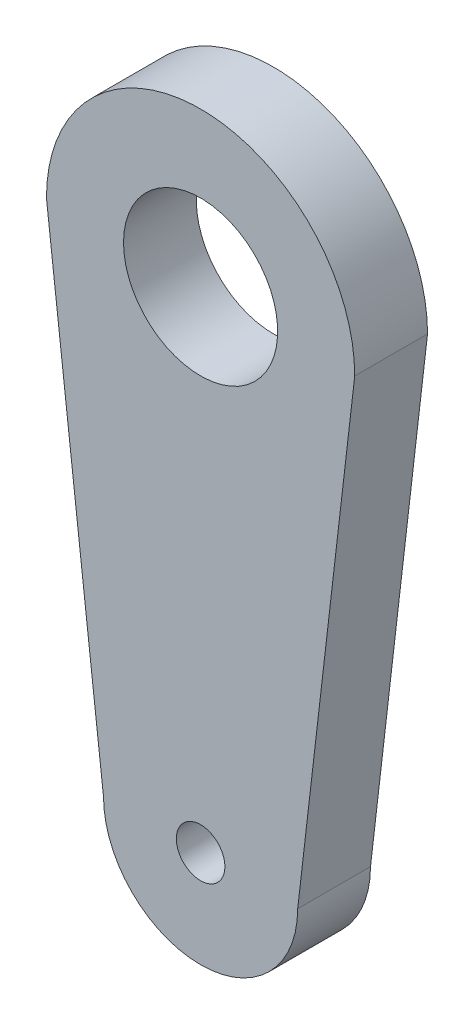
ISO-10303-21;
HEADER;
FILE_DESCRIPTION(('STEP AP214'),'2;1');
FILE_NAME('part.step','',(''),(''),'','','');
FILE_SCHEMA(('AUTOMOTIVE_DESIGN { 1 0 10303 214 1 1 1 1 }'));
ENDSEC;
DATA;
#1=APPLICATION_CONTEXT('core data for automotive mechanical design processes');
#2=APPLICATION_PROTOCOL_DEFINITION('international standard','automotive_design',2000,#1);
#3=PRODUCT_CONTEXT('',#1,'mechanical');
#4=PRODUCT('Part','Part','',(#3));
#5=PRODUCT_RELATED_PRODUCT_CATEGORY('part','',(#4));
#6=PRODUCT_DEFINITION_FORMATION('','',#4);
#7=PRODUCT_DEFINITION_CONTEXT('part definition',#1,'design');
#8=PRODUCT_DEFINITION('design','',#6,#7);
#9=PRODUCT_DEFINITION_SHAPE('','',#8);
#10=(LENGTH_UNIT() NAMED_UNIT(*) SI_UNIT(.MILLI.,.METRE.));
#11=(NAMED_UNIT(*) PLANE_ANGLE_UNIT() SI_UNIT($,.RADIAN.));
#12=(NAMED_UNIT(*) SI_UNIT($,.STERADIAN.) SOLID_ANGLE_UNIT());
#13=UNCERTAINTY_MEASURE_WITH_UNIT(LENGTH_MEASURE(1.E-05),#10,'distance_accuracy_value','');
#14=(GEOMETRIC_REPRESENTATION_CONTEXT(3) GLOBAL_UNCERTAINTY_ASSIGNED_CONTEXT((#13)) GLOBAL_UNIT_ASSIGNED_CONTEXT((#10,
#11,#12)) REPRESENTATION_CONTEXT('',''));
#15=CARTESIAN_POINT('',(0.,0.,0.));
#16=DIRECTION('',(0.,0.,1.));
#17=DIRECTION('',(1.,0.,0.));
#18=AXIS2_PLACEMENT_3D('',#15,#16,#17);
#19=CARTESIAN_POINT('',(0.,-20.1836542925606,1.49987));
#20=DIRECTION('',(0.,0.,-1.));
#21=DIRECTION('',(-1.,0.,0.));
#22=AXIS2_PLACEMENT_3D('',#19,#20,#21);
#23=CYLINDRICAL_SURFACE('',#22,4.000000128);
#24=CARTESIAN_POINT('',(0.,-20.1836542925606,-1.49987));
#25=DIRECTION('',(0.,0.,1.));
#26=DIRECTION('',(1.,0.,0.));
#27=AXIS2_PLACEMENT_3D('',#24,#25,#26);
#28=CIRCLE('',#27,4.000000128);
#29=CARTESIAN_POINT('',(-4.000000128,-20.1836542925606,-1.49987));
#30=VERTEX_POINT('',#29);
#31=CARTESIAN_POINT('',(4.000000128,-20.1836542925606,-1.49987));
#32=VERTEX_POINT('',#31);
#33=EDGE_CURVE('E114',#30,#32,#28,.T.);
#34=ORIENTED_EDGE('',*,*,#33,.T.);
#35=DIRECTION('',(0.,0.,-1.));
#36=VECTOR('',#35,1.);
#37=CARTESIAN_POINT('',(4.000000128,-20.1836542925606,1.49987));
#38=LINE('',#37,#36);
#39=CARTESIAN_POINT('',(4.000000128,-20.1836542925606,1.49987));
#40=VERTEX_POINT('',#39);
#41=EDGE_CURVE('E11',#40,#32,#38,.T.);
#42=ORIENTED_EDGE('',*,*,#41,.F.);
#43=CARTESIAN_POINT('',(0.,-20.1836542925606,1.49987));
#44=DIRECTION('',(0.,0.,1.));
#45=DIRECTION('',(1.,0.,0.));
#46=AXIS2_PLACEMENT_3D('',#43,#44,#45);
#47=CIRCLE('',#46,4.000000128);
#48=CARTESIAN_POINT('',(-4.000000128,-20.1836542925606,1.49987));
#49=VERTEX_POINT('',#48);
#50=EDGE_CURVE('E85',#49,#40,#47,.T.);
#51=ORIENTED_EDGE('',*,*,#50,.F.);
#52=DIRECTION('',(0.,0.,-1.));
#53=VECTOR('',#52,1.);
#54=CARTESIAN_POINT('',(-4.000000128,-20.1836542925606,1.49987));
#55=LINE('',#54,#53);
#56=EDGE_CURVE('E113',#49,#30,#55,.T.);
#57=ORIENTED_EDGE('',*,*,#56,.T.);
#58=EDGE_LOOP('',(#34,#42,#51,#57));
#59=FACE_BOUND('',#58,.T.);
#60=ADVANCED_FACE('F43',(#59),#23,.T.);
#61=CARTESIAN_POINT('',(6.26506982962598,-0.729447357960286,1.49987));
#62=DIRECTION('',(0.993290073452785,-0.1156496,0.));
#63=DIRECTION('',(0.1156496,0.993290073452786,0.));
#64=AXIS2_PLACEMENT_3D('',#61,#62,#63);
#65=PLANE('',#64);
#66=DIRECTION('',(-0.1156496,-0.993290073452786,0.));
#67=VECTOR('',#66,1.);
#68=CARTESIAN_POINT('',(6.26506982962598,-0.729447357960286,-1.49987));
#69=LINE('',#68,#67);
#70=CARTESIAN_POINT('',(6.35,0.,-1.49987));
#71=VERTEX_POINT('',#70);
#72=EDGE_CURVE('E95',#71,#32,#69,.T.);
#73=ORIENTED_EDGE('',*,*,#72,.F.);
#74=DIRECTION('',(0.,0.,-1.));
#75=VECTOR('',#74,1.);
#76=CARTESIAN_POINT('',(6.35,0.,1.49987));
#77=LINE('',#76,#75);
#78=CARTESIAN_POINT('',(6.35,0.,1.49987));
#79=VERTEX_POINT('',#78);
#80=EDGE_CURVE('E51',#79,#71,#77,.T.);
#81=ORIENTED_EDGE('',*,*,#80,.F.);
#82=DIRECTION('',(-0.1156496,-0.993290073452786,0.));
#83=VECTOR('',#82,1.);
#84=CARTESIAN_POINT('',(6.26506982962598,-0.729447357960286,1.49987));
#85=LINE('',#84,#83);
#86=EDGE_CURVE('E93',#79,#40,#85,.T.);
#87=ORIENTED_EDGE('',*,*,#86,.T.);
#88=ORIENTED_EDGE('',*,*,#41,.T.);
#89=EDGE_LOOP('',(#73,#81,#87,#88));
#90=FACE_BOUND('',#89,.T.);
#91=ADVANCED_FACE('F92',(#90),#65,.T.);
#92=CARTESIAN_POINT('',(0.,0.,1.49987));
#93=DIRECTION('',(0.,0.,-1.));
#94=DIRECTION('',(-1.,0.,0.));
#95=AXIS2_PLACEMENT_3D('',#92,#93,#94);
#96=CYLINDRICAL_SURFACE('',#95,6.35);
#97=CARTESIAN_POINT('',(0.,0.,-1.49987));
#98=DIRECTION('',(0.,0.,1.));
#99=DIRECTION('',(1.,0.,0.));
#100=AXIS2_PLACEMENT_3D('',#97,#98,#99);
#101=CIRCLE('',#100,6.35);
#102=CARTESIAN_POINT('',(-6.35,0.,-1.49987));
#103=VERTEX_POINT('',#102);
#104=EDGE_CURVE('E74',#71,#103,#101,.T.);
#105=ORIENTED_EDGE('',*,*,#104,.T.);
#106=DIRECTION('',(0.,0.,-1.));
#107=VECTOR('',#106,1.);
#108=CARTESIAN_POINT('',(-6.35,0.,1.49987));
#109=LINE('',#108,#107);
#110=CARTESIAN_POINT('',(-6.35,0.,1.49987));
#111=VERTEX_POINT('',#110);
#112=EDGE_CURVE('E96',#111,#103,#109,.T.);
#113=ORIENTED_EDGE('',*,*,#112,.F.);
#114=CARTESIAN_POINT('',(0.,0.,1.49987));
#115=DIRECTION('',(0.,0.,1.));
#116=DIRECTION('',(1.,0.,0.));
#117=AXIS2_PLACEMENT_3D('',#114,#115,#116);
#118=CIRCLE('',#117,6.35);
#119=EDGE_CURVE('E97',#79,#111,#118,.T.);
#120=ORIENTED_EDGE('',*,*,#119,.F.);
#121=ORIENTED_EDGE('',*,*,#80,.T.);
#122=EDGE_LOOP('',(#105,#113,#120,#121));
#123=FACE_BOUND('',#122,.T.);
#124=ADVANCED_FACE('F98',(#123),#96,.T.);
#125=CARTESIAN_POINT('',(0.,-20.1836542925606,1.49987));
#126=DIRECTION('',(0.,0.,-1.));
#127=DIRECTION('',(-1.,0.,0.));
#128=AXIS2_PLACEMENT_3D('',#125,#126,#127);
#129=CYLINDRICAL_SURFACE('',#128,1.00000003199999);
#130=CARTESIAN_POINT('',(0.,-20.1836542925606,1.49987));
#131=DIRECTION('',(0.,0.,1.));
#132=DIRECTION('',(1.,0.,0.));
#133=AXIS2_PLACEMENT_3D('',#130,#131,#132);
#134=CIRCLE('',#133,1.00000003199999);
#135=CARTESIAN_POINT('',(-1.00000003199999,-20.1836542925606,1.49987));
#136=VERTEX_POINT('',#135);
#137=EDGE_CURVE('E107',#136,#136,#134,.T.);
#138=CARTESIAN_POINT('',(0.,-20.1836542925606,-1.49987));
#139=DIRECTION('',(0.,0.,1.));
#140=DIRECTION('',(1.,0.,0.));
#141=AXIS2_PLACEMENT_3D('',#138,#139,#140);
#142=CIRCLE('',#141,1.00000003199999);
#143=CARTESIAN_POINT('',(-1.00000003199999,-20.1836542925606,-1.49987));
#144=VERTEX_POINT('',#143);
#145=EDGE_CURVE('E120',#144,#144,#142,.T.);
#146=CARTESIAN_POINT('',(-1.00000003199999,-20.1836542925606,1.49987));
#147=CARTESIAN_POINT('',(-1.00000003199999,-20.1836542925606,1.46862270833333));
#148=CARTESIAN_POINT('',(-1.00000003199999,-20.1836542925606,1.43737541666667));
#149=CARTESIAN_POINT('',(-1.00000003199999,-20.1836542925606,1.37488083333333));
#150=CARTESIAN_POINT('',(-1.00000003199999,-20.1836542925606,1.34363354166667));
#151=CARTESIAN_POINT('',(-1.00000003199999,-20.1836542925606,1.28113895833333));
#152=CARTESIAN_POINT('',(-1.00000003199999,-20.1836542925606,1.24989166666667));
#153=CARTESIAN_POINT('',(-1.00000003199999,-20.1836542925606,1.18739708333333));
#154=CARTESIAN_POINT('',(-1.00000003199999,-20.1836542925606,1.15614979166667));
#155=CARTESIAN_POINT('',(-1.00000003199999,-20.1836542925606,1.09365520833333));
#156=CARTESIAN_POINT('',(-1.00000003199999,-20.1836542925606,1.06240791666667));
#157=CARTESIAN_POINT('',(-1.00000003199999,-20.1836542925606,0.999913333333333));
#158=CARTESIAN_POINT('',(-1.00000003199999,-20.1836542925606,0.968666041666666));
#159=CARTESIAN_POINT('',(-1.00000003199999,-20.1836542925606,0.906171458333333));
#160=CARTESIAN_POINT('',(-1.00000003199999,-20.1836542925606,0.874924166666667));
#161=CARTESIAN_POINT('',(-1.00000003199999,-20.1836542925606,0.812429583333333));
#162=CARTESIAN_POINT('',(-1.00000003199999,-20.1836542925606,0.781182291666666));
#163=CARTESIAN_POINT('',(-1.00000003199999,-20.1836542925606,0.718687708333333));
#164=CARTESIAN_POINT('',(-1.00000003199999,-20.1836542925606,0.687440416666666));
#165=CARTESIAN_POINT('',(-1.00000003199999,-20.1836542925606,0.624945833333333));
#166=CARTESIAN_POINT('',(-1.00000003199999,-20.1836542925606,0.593698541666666));
#167=CARTESIAN_POINT('',(-1.00000003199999,-20.1836542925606,0.531203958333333));
#168=CARTESIAN_POINT('',(-1.00000003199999,-20.1836542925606,0.499956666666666));
#169=CARTESIAN_POINT('',(-1.00000003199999,-20.1836542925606,0.437462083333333));
#170=CARTESIAN_POINT('',(-1.00000003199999,-20.1836542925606,0.406214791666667));
#171=CARTESIAN_POINT('',(-1.00000003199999,-20.1836542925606,0.343720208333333));
#172=CARTESIAN_POINT('',(-1.00000003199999,-20.1836542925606,0.312472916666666));
#173=CARTESIAN_POINT('',(-1.00000003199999,-20.1836542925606,0.249978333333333));
#174=CARTESIAN_POINT('',(-1.00000003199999,-20.1836542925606,0.218731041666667));
#175=CARTESIAN_POINT('',(-1.00000003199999,-20.1836542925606,0.156236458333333));
#176=CARTESIAN_POINT('',(-1.00000003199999,-20.1836542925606,0.124989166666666));
#177=CARTESIAN_POINT('',(-1.00000003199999,-20.1836542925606,0.0624945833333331));
#178=CARTESIAN_POINT('',(-1.00000003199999,-20.1836542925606,0.0312472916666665));
#179=CARTESIAN_POINT('',(-1.00000003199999,-20.1836542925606,-0.0312472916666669));
#180=CARTESIAN_POINT('',(-1.00000003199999,-20.1836542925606,-0.0624945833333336));
#181=CARTESIAN_POINT('',(-1.00000003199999,-20.1836542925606,-0.124989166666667));
#182=CARTESIAN_POINT('',(-1.00000003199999,-20.1836542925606,-0.156236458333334));
#183=CARTESIAN_POINT('',(-1.00000003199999,-20.1836542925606,-0.218731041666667));
#184=CARTESIAN_POINT('',(-1.00000003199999,-20.1836542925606,-0.249978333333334));
#185=CARTESIAN_POINT('',(-1.00000003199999,-20.1836542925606,-0.312472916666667));
#186=CARTESIAN_POINT('',(-1.00000003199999,-20.1836542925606,-0.343720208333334));
#187=CARTESIAN_POINT('',(-1.00000003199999,-20.1836542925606,-0.406214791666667));
#188=CARTESIAN_POINT('',(-1.00000003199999,-20.1836542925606,-0.437462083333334));
#189=CARTESIAN_POINT('',(-1.00000003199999,-20.1836542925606,-0.499956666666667));
#190=CARTESIAN_POINT('',(-1.00000003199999,-20.1836542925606,-0.531203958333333));
#191=CARTESIAN_POINT('',(-1.00000003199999,-20.1836542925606,-0.593698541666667));
#192=CARTESIAN_POINT('',(-1.00000003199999,-20.1836542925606,-0.624945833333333));
#193=CARTESIAN_POINT('',(-1.00000003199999,-20.1836542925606,-0.687440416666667));
#194=CARTESIAN_POINT('',(-1.00000003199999,-20.1836542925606,-0.718687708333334));
#195=CARTESIAN_POINT('',(-1.00000003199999,-20.1836542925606,-0.781182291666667));
#196=CARTESIAN_POINT('',(-1.00000003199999,-20.1836542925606,-0.812429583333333));
#197=CARTESIAN_POINT('',(-1.00000003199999,-20.1836542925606,-0.874924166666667));
#198=CARTESIAN_POINT('',(-1.00000003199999,-20.1836542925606,-0.906171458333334));
#199=CARTESIAN_POINT('',(-1.00000003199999,-20.1836542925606,-0.968666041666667));
#200=CARTESIAN_POINT('',(-1.00000003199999,-20.1836542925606,-0.999913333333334));
#201=CARTESIAN_POINT('',(-1.00000003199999,-20.1836542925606,-1.06240791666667));
#202=CARTESIAN_POINT('',(-1.00000003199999,-20.1836542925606,-1.09365520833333));
#203=CARTESIAN_POINT('',(-1.00000003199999,-20.1836542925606,-1.15614979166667));
#204=CARTESIAN_POINT('',(-1.00000003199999,-20.1836542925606,-1.18739708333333));
#205=CARTESIAN_POINT('',(-1.00000003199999,-20.1836542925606,-1.24989166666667));
#206=CARTESIAN_POINT('',(-1.00000003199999,-20.1836542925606,-1.28113895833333));
#207=CARTESIAN_POINT('',(-1.00000003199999,-20.1836542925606,-1.34363354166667));
#208=CARTESIAN_POINT('',(-1.00000003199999,-20.1836542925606,-1.37488083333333));
#209=CARTESIAN_POINT('',(-1.00000003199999,-20.1836542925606,-1.43737541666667));
#210=CARTESIAN_POINT('',(-1.00000003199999,-20.1836542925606,-1.46862270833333));
#211=CARTESIAN_POINT('',(-1.00000003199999,-20.1836542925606,-1.49987));
#212=B_SPLINE_CURVE_WITH_KNOTS('',3,(#146,#147,#148,#149,#150,#151,#152,#153,#154,#155,#156,
#157,#158,#159,#160,#161,#162,#163,#164,#165,#166,#167,#168,#169,#170,#171,#172,#173,#174,#175,
#176,#177,#178,#179,#180,#181,#182,#183,#184,#185,#186,#187,#188,#189,#190,#191,#192,#193,#194,
#195,#196,#197,#198,#199,#200,#201,#202,#203,#204,#205,#206,#207,#208,#209,#210,#211),
.UNSPECIFIED.,.F.,.F.,(4,2,2,2,2,2,2,2,2,2,2,2,2,2,2,2,2,2,2,2,2,2,2,2,2,2,2,2,2,2,2,2,4),(0.,
0.093741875,0.18748375,0.281225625,0.3749675,0.468709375,0.56245125,0.656193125,0.749935,
0.843676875,0.93741875,1.031160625,1.1249025,1.218644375,1.31238625,1.406128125,1.49987,
1.593611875,1.68735375,1.781095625,1.8748375,1.968579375,2.06232125,2.156063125,2.249805,
2.343546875,2.43728875,2.531030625,2.6247725,2.718514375,2.81225625,2.905998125,2.99974),.UNSPECIFIED.);
#213=EDGE_CURVE('BSEAM139',#136,#144,#212,.T.);
#214=ORIENTED_EDGE('',*,*,#137,.T.);
#215=ORIENTED_EDGE('',*,*,#145,.F.);
#216=ORIENTED_EDGE('',*,*,#213,.T.);
#217=ORIENTED_EDGE('',*,*,#213,.F.);
#218=EDGE_LOOP('',(#214,#216,#215,#217));
#219=FACE_BOUND('',#218,.T.);
#220=ADVANCED_FACE('F139',(#219),#129,.F.);
#221=CARTESIAN_POINT('',(-6.26506982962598,-0.729447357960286,1.49987));
#222=DIRECTION('',(0.993290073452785,0.1156496,0.));
#223=DIRECTION('',(-0.1156496,0.993290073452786,0.));
#224=AXIS2_PLACEMENT_3D('',#221,#222,#223);
#225=PLANE('',#224);
#226=DIRECTION('',(0.1156496,-0.993290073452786,0.));
#227=VECTOR('',#226,1.);
#228=CARTESIAN_POINT('',(-6.26506982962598,-0.729447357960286,-1.49987));
#229=LINE('',#228,#227);
#230=EDGE_CURVE('E80',#103,#30,#229,.T.);
#231=ORIENTED_EDGE('',*,*,#230,.T.);
#232=ORIENTED_EDGE('',*,*,#56,.F.);
#233=DIRECTION('',(0.1156496,-0.993290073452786,0.));
#234=VECTOR('',#233,1.);
#235=CARTESIAN_POINT('',(-6.26506982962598,-0.729447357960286,1.49987));
#236=LINE('',#235,#234);
#237=EDGE_CURVE('E59',#111,#49,#236,.T.);
#238=ORIENTED_EDGE('',*,*,#237,.F.);
#239=ORIENTED_EDGE('',*,*,#112,.T.);
#240=EDGE_LOOP('',(#231,#232,#238,#239));
#241=FACE_BOUND('',#240,.T.);
#242=ADVANCED_FACE('F126',(#241),#225,.F.);
#243=CARTESIAN_POINT('',(0.,0.,1.49987));
#244=DIRECTION('',(0.,0.,-1.));
#245=DIRECTION('',(-1.,0.,0.));
#246=AXIS2_PLACEMENT_3D('',#243,#244,#245);
#247=CYLINDRICAL_SURFACE('',#246,3.175);
#248=CARTESIAN_POINT('',(0.,0.,1.49987));
#249=DIRECTION('',(0.,0.,1.));
#250=DIRECTION('',(1.,0.,0.));
#251=AXIS2_PLACEMENT_3D('',#248,#249,#250);
#252=CIRCLE('',#251,3.175);
#253=CARTESIAN_POINT('',(-3.175,0.,1.49987));
#254=VERTEX_POINT('',#253);
#255=EDGE_CURVE('E110',#254,#254,#252,.T.);
#256=CARTESIAN_POINT('',(0.,0.,-1.49987));
#257=DIRECTION('',(0.,0.,1.));
#258=DIRECTION('',(1.,0.,0.));
#259=AXIS2_PLACEMENT_3D('',#256,#257,#258);
#260=CIRCLE('',#259,3.175);
#261=CARTESIAN_POINT('',(-3.175,0.,-1.49987));
#262=VERTEX_POINT('',#261);
#263=EDGE_CURVE('E103',#262,#262,#260,.T.);
#264=CARTESIAN_POINT('',(-3.175,0.,1.49987));
#265=CARTESIAN_POINT('',(-3.175,0.,1.46862270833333));
#266=CARTESIAN_POINT('',(-3.175,0.,1.43737541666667));
#267=CARTESIAN_POINT('',(-3.175,0.,1.37488083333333));
#268=CARTESIAN_POINT('',(-3.175,0.,1.34363354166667));
#269=CARTESIAN_POINT('',(-3.175,0.,1.28113895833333));
#270=CARTESIAN_POINT('',(-3.175,0.,1.24989166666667));
#271=CARTESIAN_POINT('',(-3.175,0.,1.18739708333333));
#272=CARTESIAN_POINT('',(-3.175,0.,1.15614979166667));
#273=CARTESIAN_POINT('',(-3.175,0.,1.09365520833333));
#274=CARTESIAN_POINT('',(-3.175,0.,1.06240791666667));
#275=CARTESIAN_POINT('',(-3.175,0.,0.999913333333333));
#276=CARTESIAN_POINT('',(-3.175,0.,0.968666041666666));
#277=CARTESIAN_POINT('',(-3.175,0.,0.906171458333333));
#278=CARTESIAN_POINT('',(-3.175,0.,0.874924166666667));
#279=CARTESIAN_POINT('',(-3.175,0.,0.812429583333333));
#280=CARTESIAN_POINT('',(-3.175,0.,0.781182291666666));
#281=CARTESIAN_POINT('',(-3.175,0.,0.718687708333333));
#282=CARTESIAN_POINT('',(-3.175,0.,0.687440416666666));
#283=CARTESIAN_POINT('',(-3.175,0.,0.624945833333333));
#284=CARTESIAN_POINT('',(-3.175,0.,0.593698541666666));
#285=CARTESIAN_POINT('',(-3.175,0.,0.531203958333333));
#286=CARTESIAN_POINT('',(-3.175,0.,0.499956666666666));
#287=CARTESIAN_POINT('',(-3.175,0.,0.437462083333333));
#288=CARTESIAN_POINT('',(-3.175,0.,0.406214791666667));
#289=CARTESIAN_POINT('',(-3.175,0.,0.343720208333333));
#290=CARTESIAN_POINT('',(-3.175,0.,0.312472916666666));
#291=CARTESIAN_POINT('',(-3.175,0.,0.249978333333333));
#292=CARTESIAN_POINT('',(-3.175,0.,0.218731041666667));
#293=CARTESIAN_POINT('',(-3.175,0.,0.156236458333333));
#294=CARTESIAN_POINT('',(-3.175,0.,0.124989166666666));
#295=CARTESIAN_POINT('',(-3.175,0.,0.0624945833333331));
#296=CARTESIAN_POINT('',(-3.175,0.,0.0312472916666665));
#297=CARTESIAN_POINT('',(-3.175,0.,-0.0312472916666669));
#298=CARTESIAN_POINT('',(-3.175,0.,-0.0624945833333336));
#299=CARTESIAN_POINT('',(-3.175,0.,-0.124989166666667));
#300=CARTESIAN_POINT('',(-3.175,0.,-0.156236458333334));
#301=CARTESIAN_POINT('',(-3.175,0.,-0.218731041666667));
#302=CARTESIAN_POINT('',(-3.175,0.,-0.249978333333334));
#303=CARTESIAN_POINT('',(-3.175,0.,-0.312472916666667));
#304=CARTESIAN_POINT('',(-3.175,0.,-0.343720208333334));
#305=CARTESIAN_POINT('',(-3.175,0.,-0.406214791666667));
#306=CARTESIAN_POINT('',(-3.175,0.,-0.437462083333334));
#307=CARTESIAN_POINT('',(-3.175,0.,-0.499956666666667));
#308=CARTESIAN_POINT('',(-3.175,0.,-0.531203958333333));
#309=CARTESIAN_POINT('',(-3.175,0.,-0.593698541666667));
#310=CARTESIAN_POINT('',(-3.175,0.,-0.624945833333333));
#311=CARTESIAN_POINT('',(-3.175,0.,-0.687440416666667));
#312=CARTESIAN_POINT('',(-3.175,0.,-0.718687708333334));
#313=CARTESIAN_POINT('',(-3.175,0.,-0.781182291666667));
#314=CARTESIAN_POINT('',(-3.175,0.,-0.812429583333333));
#315=CARTESIAN_POINT('',(-3.175,0.,-0.874924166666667));
#316=CARTESIAN_POINT('',(-3.175,0.,-0.906171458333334));
#317=CARTESIAN_POINT('',(-3.175,0.,-0.968666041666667));
#318=CARTESIAN_POINT('',(-3.175,0.,-0.999913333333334));
#319=CARTESIAN_POINT('',(-3.175,0.,-1.06240791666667));
#320=CARTESIAN_POINT('',(-3.175,0.,-1.09365520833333));
#321=CARTESIAN_POINT('',(-3.175,0.,-1.15614979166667));
#322=CARTESIAN_POINT('',(-3.175,0.,-1.18739708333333));
#323=CARTESIAN_POINT('',(-3.175,0.,-1.24989166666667));
#324=CARTESIAN_POINT('',(-3.175,0.,-1.28113895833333));
#325=CARTESIAN_POINT('',(-3.175,0.,-1.34363354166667));
#326=CARTESIAN_POINT('',(-3.175,0.,-1.37488083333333));
#327=CARTESIAN_POINT('',(-3.175,0.,-1.43737541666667));
#328=CARTESIAN_POINT('',(-3.175,0.,-1.46862270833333));
#329=CARTESIAN_POINT('',(-3.175,0.,-1.49987));
#330=B_SPLINE_CURVE_WITH_KNOTS('',3,(#264,#265,#266,#267,#268,#269,#270,#271,#272,#273,#274,
#275,#276,#277,#278,#279,#280,#281,#282,#283,#284,#285,#286,#287,#288,#289,#290,#291,#292,#293,
#294,#295,#296,#297,#298,#299,#300,#301,#302,#303,#304,#305,#306,#307,#308,#309,#310,#311,#312,
#313,#314,#315,#316,#317,#318,#319,#320,#321,#322,#323,#324,#325,#326,#327,#328,#329),
.UNSPECIFIED.,.F.,.F.,(4,2,2,2,2,2,2,2,2,2,2,2,2,2,2,2,2,2,2,2,2,2,2,2,2,2,2,2,2,2,2,2,4),(0.,
0.093741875,0.18748375,0.281225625,0.3749675,0.468709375,0.56245125,0.656193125,0.749935,
0.843676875,0.93741875,1.031160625,1.1249025,1.218644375,1.31238625,1.406128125,1.49987,
1.593611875,1.68735375,1.781095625,1.8748375,1.968579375,2.06232125,2.156063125,2.249805,
2.343546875,2.43728875,2.531030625,2.6247725,2.718514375,2.81225625,2.905998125,2.99974),.UNSPECIFIED.);
#331=EDGE_CURVE('BSEAM144',#254,#262,#330,.T.);
#332=ORIENTED_EDGE('',*,*,#255,.T.);
#333=ORIENTED_EDGE('',*,*,#263,.F.);
#334=ORIENTED_EDGE('',*,*,#331,.T.);
#335=ORIENTED_EDGE('',*,*,#331,.F.);
#336=EDGE_LOOP('',(#332,#334,#333,#335));
#337=FACE_BOUND('',#336,.T.);
#338=ADVANCED_FACE('F144',(#337),#247,.F.);
#339=CARTESIAN_POINT('',(0.,0.,1.49987));
#340=DIRECTION('',(0.,0.,1.));
#341=DIRECTION('',(1.,0.,0.));
#342=AXIS2_PLACEMENT_3D('',#339,#340,#341);
#343=PLANE('',#342);
#344=ORIENTED_EDGE('',*,*,#50,.T.);
#345=ORIENTED_EDGE('',*,*,#86,.F.);
#346=ORIENTED_EDGE('',*,*,#119,.T.);
#347=ORIENTED_EDGE('',*,*,#237,.T.);
#348=EDGE_LOOP('',(#344,#345,#346,#347));
#349=FACE_BOUND('',#348,.T.);
#350=ORIENTED_EDGE('',*,*,#137,.F.);
#351=EDGE_LOOP('',(#350));
#352=FACE_BOUND('',#351,.T.);
#353=ORIENTED_EDGE('',*,*,#255,.F.);
#354=EDGE_LOOP('',(#353));
#355=FACE_BOUND('',#354,.T.);
#356=ADVANCED_FACE('F100',(#349,#352,#355),#343,.T.);
#357=CARTESIAN_POINT('',(0.,0.,-1.49987));
#358=DIRECTION('',(0.,0.,1.));
#359=DIRECTION('',(1.,0.,0.));
#360=AXIS2_PLACEMENT_3D('',#357,#358,#359);
#361=PLANE('',#360);
#362=ORIENTED_EDGE('',*,*,#33,.F.);
#363=ORIENTED_EDGE('',*,*,#230,.F.);
#364=ORIENTED_EDGE('',*,*,#104,.F.);
#365=ORIENTED_EDGE('',*,*,#72,.T.);
#366=EDGE_LOOP('',(#362,#363,#364,#365));
#367=FACE_BOUND('',#366,.T.);
#368=ORIENTED_EDGE('',*,*,#145,.T.);
#369=EDGE_LOOP('',(#368));
#370=FACE_BOUND('',#369,.T.);
#371=ORIENTED_EDGE('',*,*,#263,.T.);
#372=EDGE_LOOP('',(#371));
#373=FACE_BOUND('',#372,.T.);
#374=ADVANCED_FACE('F129',(#367,#370,#373),#361,.F.);
#375=CLOSED_SHELL('',(#60,#91,#124,#220,#242,#338,#356,#374));
#376=MANIFOLD_SOLID_BREP('B2',#375);
#377=ADVANCED_BREP_SHAPE_REPRESENTATION('',(#18,#376),#14);
#378=SHAPE_DEFINITION_REPRESENTATION(#9,#377);
ENDSEC;
END-ISO-10303-21;
